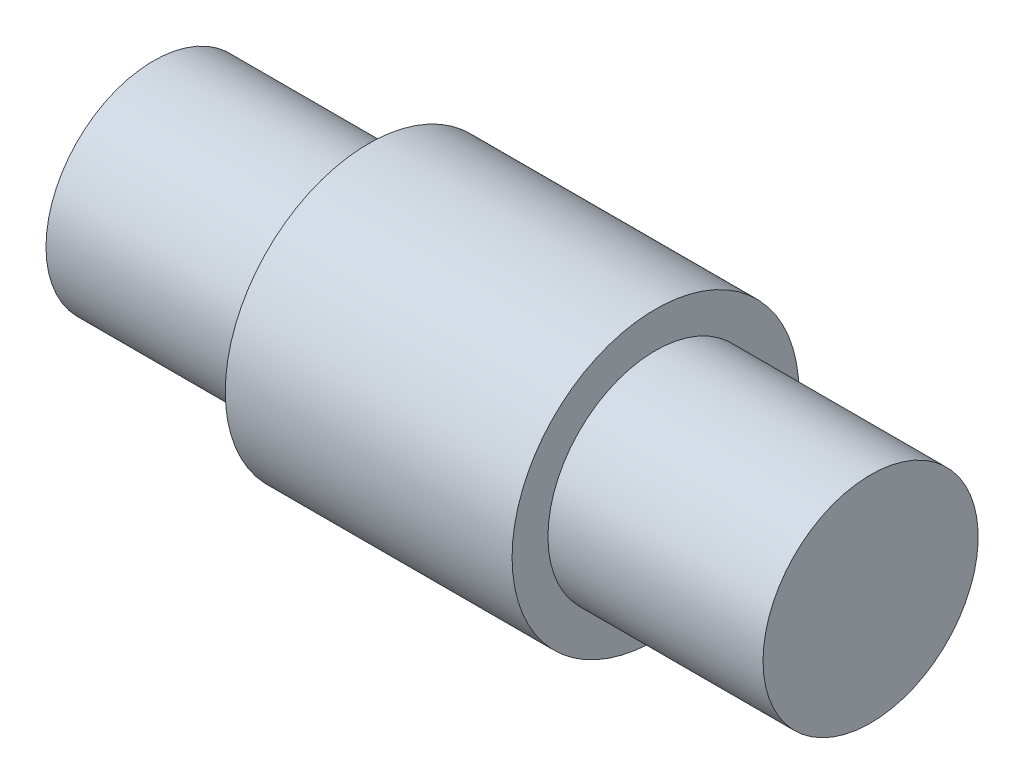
from build123d import *


with BuildPart() as part:
    # Sketch2 → Revolve1 (revolve)
    with BuildSketch(Plane.XY, mode=Mode.PRIVATE) as revolve1_sk:
        Polygon((-8.591517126, 0), (11.408482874, 0), (11.408482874, -3), (5.408482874, -3), (5.408482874, -4), (-2.591517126, -4), (-2.591517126, -3), (-8.591517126, -3), align=None)
    revolve(revolve1_sk.sketch.rotate(Axis((-8.591517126, 0, 0), (1, 0, 0)), 270), axis=Axis((-8.591517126, 0, 0), (1, 0, 0)))


solid = part.part
